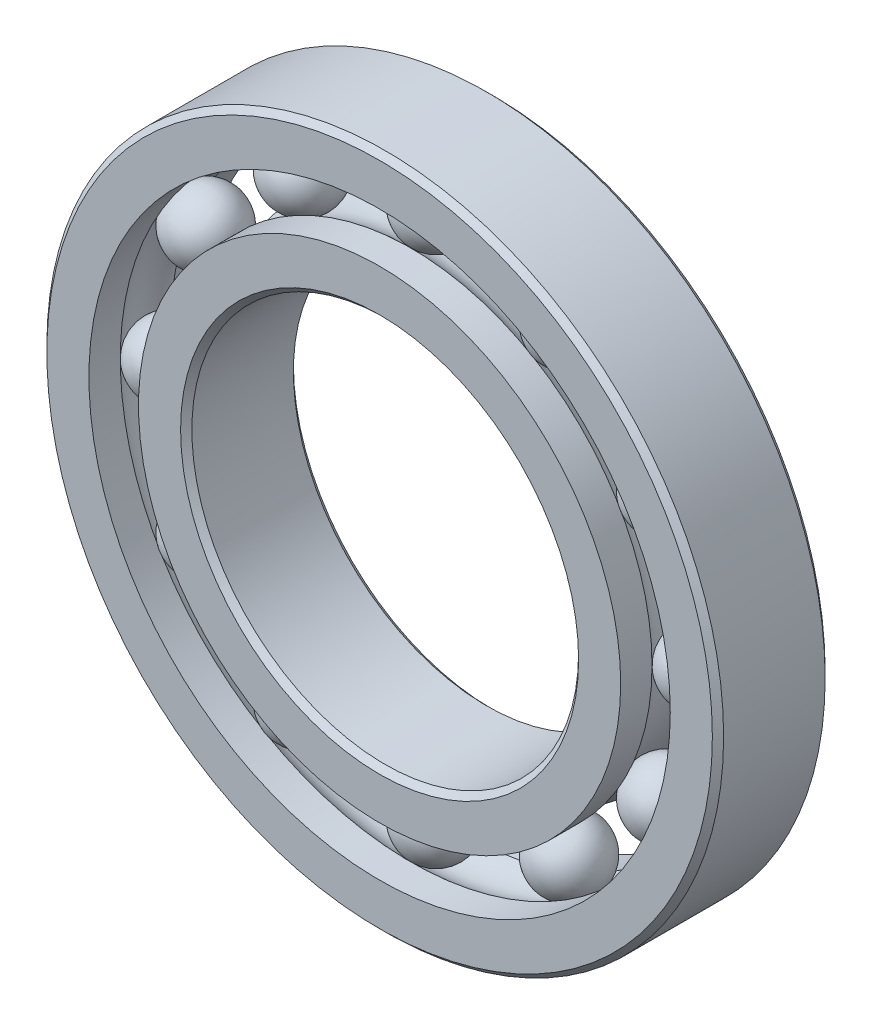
from build123d import *

# Parameters (mm, degrees)
CIRPATTERN1_COUNT = 12


with BuildPart() as part:
    # Sketch1 → Revolve1 (revolve)
    with BuildSketch(Plane(origin=(0, 0, 0), x_dir=(0, 0, -1), z_dir=(1, 0, 0)), mode=Mode.PRIVATE) as revolve1_sk:
        with BuildLine():
            Line((5.000625, 33.3375), (-5.000625, 33.3375))
            Line((-5.000625, 33.3375), (-5.55625, 32.781875))
            Line((-5.55625, 32.781875), (-5.55625, 28.636057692))
            Line((-5.55625, 28.636057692), (-2.469444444, 28.636057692))
            ThreePointArc((-2.469444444, 28.636057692), (0, 29.66693625), (2.469444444, 28.636057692))
            Line((2.469444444, 28.636057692), (5.55625, 28.636057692))
            Line((5.55625, 28.636057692), (5.55625, 32.781875))
            Line((5.55625, 32.781875), (5.000625, 33.3375))
        make_face()
    revolve(revolve1_sk.sketch.rotate(Axis((0, 0, 5.55625), (0, 0, -1)), 90), axis=Axis((0, 0, 5.55625), (0, 0, -1)))


with BuildPart() as body_2:
    # Sketch3 → Revolve3 (revolve)
    with BuildSketch(Plane(origin=(0, 0, 0), x_dir=(0, 0, -1), z_dir=(1, 0, 0)), mode=Mode.PRIVATE) as revolve3_sk:
        with BuildLine():
            Line((-5.55625, 23.751442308), (-2.469444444, 23.751442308))
            ThreePointArc((-2.469444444, 23.751442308), (0, 22.72056375), (2.469444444, 23.751442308))
            Line((2.469444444, 23.751442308), (5.55625, 23.751442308))
            Line((5.55625, 23.751442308), (5.55625, 19.605625))
            Line((5.55625, 19.605625), (5.000625, 19.05))
            Line((5.000625, 19.05), (-5.000625, 19.05))
            Line((-5.000625, 19.05), (-5.55625, 19.605625))
            Line((-5.55625, 19.605625), (-5.55625, 23.751442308))
        make_face()
    revolve(revolve3_sk.sketch.rotate(Axis((0, 0, 5.55625), (0, 0, -1)), 90), axis=Axis((0, 0, 5.55625), (0, 0, -1)))


with BuildPart() as body_3:
    # Sketch4 → Revolve4 (revolve)
    with BuildSketch(Plane(origin=(0, 0, 0), x_dir=(0, 0, -1), z_dir=(1, 0, 0))):
        with BuildLine():
            Line((-3.47318625, 26.19375), (3.47318625, 26.19375))
            ThreePointArc((3.47318625, 26.19375), (0, 29.66693625), (-3.47318625, 26.19375))
        make_face()
    revolve(axis=Axis((0, 26.19375, 3.47318625), (0, 0, -1)))


with BuildPart() as cirpattern1_1:
    # CirPattern1: pattern copy
    add(body_3.part.rotate(Axis((0, 0, 0), (0, 0, 1)), 1 * 360 / CIRPATTERN1_COUNT))


with BuildPart() as cirpattern1_2:
    # CirPattern1: pattern copy
    add(body_3.part.rotate(Axis((0, 0, 0), (0, 0, 1)), 2 * 360 / CIRPATTERN1_COUNT))


with BuildPart() as cirpattern1_3:
    # CirPattern1: pattern copy
    add(body_3.part.rotate(Axis((0, 0, 0), (0, 0, 1)), 3 * 360 / CIRPATTERN1_COUNT))


with BuildPart() as cirpattern1_4:
    # CirPattern1: pattern copy
    add(body_3.part.rotate(Axis((0, 0, 0), (0, 0, 1)), 4 * 360 / CIRPATTERN1_COUNT))


with BuildPart() as cirpattern1_5:
    # CirPattern1: pattern copy
    add(body_3.part.rotate(Axis((0, 0, 0), (0, 0, 1)), 5 * 360 / CIRPATTERN1_COUNT))


with BuildPart() as cirpattern1_6:
    # CirPattern1: pattern copy
    add(body_3.part.rotate(Axis((0, 0, 0), (0, 0, 1)), 6 * 360 / CIRPATTERN1_COUNT))


with BuildPart() as cirpattern1_7:
    # CirPattern1: pattern copy
    add(body_3.part.rotate(Axis((0, 0, 0), (0, 0, 1)), 7 * 360 / CIRPATTERN1_COUNT))


with BuildPart() as cirpattern1_8:
    # CirPattern1: pattern copy
    add(body_3.part.rotate(Axis((0, 0, 0), (0, 0, 1)), 8 * 360 / CIRPATTERN1_COUNT))


with BuildPart() as cirpattern1_9:
    # CirPattern1: pattern copy
    add(body_3.part.rotate(Axis((0, 0, 0), (0, 0, 1)), 9 * 360 / CIRPATTERN1_COUNT))


with BuildPart() as cirpattern1_10:
    # CirPattern1: pattern copy
    add(body_3.part.rotate(Axis((0, 0, 0), (0, 0, 1)), 10 * 360 / CIRPATTERN1_COUNT))


with BuildPart() as cirpattern1_11:
    # CirPattern1: pattern copy
    add(body_3.part.rotate(Axis((0, 0, 0), (0, 0, 1)), 11 * 360 / CIRPATTERN1_COUNT))


solid = Compound([part.part, body_2.part, body_3.part, cirpattern1_1.part, cirpattern1_2.part, cirpattern1_3.part, cirpattern1_4.part, cirpattern1_5.part, cirpattern1_6.part, cirpattern1_7.part, cirpattern1_8.part, cirpattern1_9.part, cirpattern1_10.part, cirpattern1_11.part])
